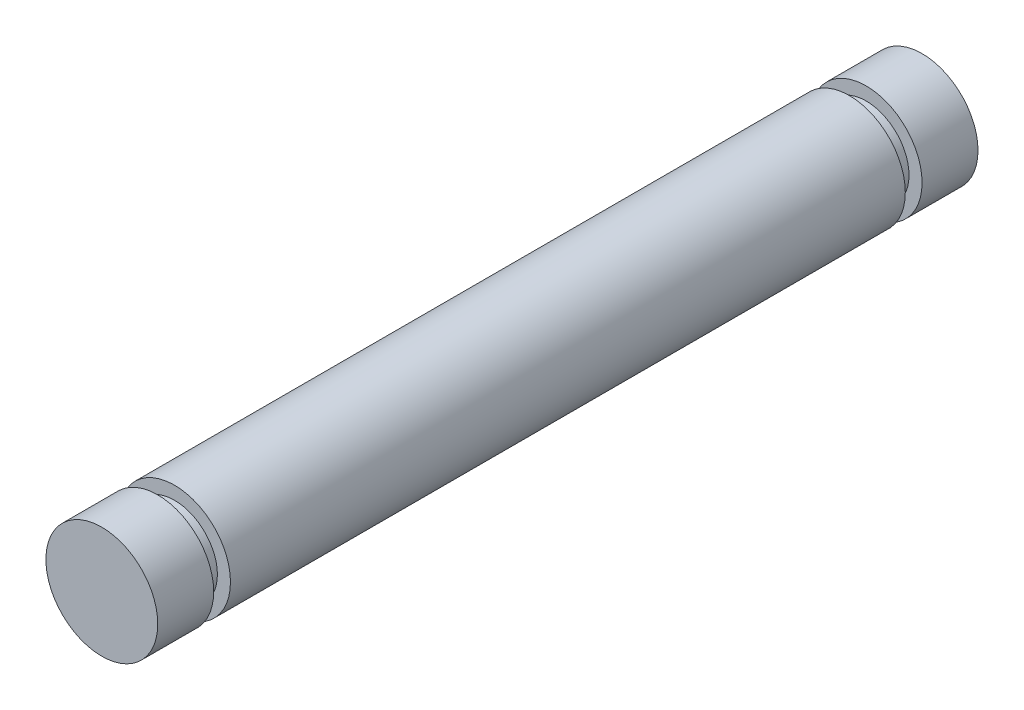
ISO-10303-21;
HEADER;
FILE_DESCRIPTION(('STEP AP214'),'2;1');
FILE_NAME('part.step','',(''),(''),'','','');
FILE_SCHEMA(('AUTOMOTIVE_DESIGN { 1 0 10303 214 1 1 1 1 }'));
ENDSEC;
DATA;
#1=APPLICATION_CONTEXT('core data for automotive mechanical design processes');
#2=APPLICATION_PROTOCOL_DEFINITION('international standard','automotive_design',2000,#1);
#3=PRODUCT_CONTEXT('',#1,'mechanical');
#4=PRODUCT('Part','Part','',(#3));
#5=PRODUCT_RELATED_PRODUCT_CATEGORY('part','',(#4));
#6=PRODUCT_DEFINITION_FORMATION('','',#4);
#7=PRODUCT_DEFINITION_CONTEXT('part definition',#1,'design');
#8=PRODUCT_DEFINITION('design','',#6,#7);
#9=PRODUCT_DEFINITION_SHAPE('','',#8);
#10=(LENGTH_UNIT() NAMED_UNIT(*) SI_UNIT(.MILLI.,.METRE.));
#11=(NAMED_UNIT(*) PLANE_ANGLE_UNIT() SI_UNIT($,.RADIAN.));
#12=(NAMED_UNIT(*) SI_UNIT($,.STERADIAN.) SOLID_ANGLE_UNIT());
#13=UNCERTAINTY_MEASURE_WITH_UNIT(LENGTH_MEASURE(1.E-05),#10,'distance_accuracy_value','');
#14=(GEOMETRIC_REPRESENTATION_CONTEXT(3) GLOBAL_UNCERTAINTY_ASSIGNED_CONTEXT((#13)) GLOBAL_UNIT_ASSIGNED_CONTEXT((#10,
#11,#12)) REPRESENTATION_CONTEXT('',''));
#15=CARTESIAN_POINT('',(0.,0.,0.));
#16=DIRECTION('',(0.,0.,1.));
#17=DIRECTION('',(1.,0.,0.));
#18=AXIS2_PLACEMENT_3D('',#15,#16,#17);
#19=CARTESIAN_POINT('',(-14.75,36.,11.));
#20=DIRECTION('',(0.,0.,-1.));
#21=DIRECTION('',(-1.,0.,0.));
#22=AXIS2_PLACEMENT_3D('',#19,#20,#21);
#23=CYLINDRICAL_SURFACE('',#22,1.5);
#24=CARTESIAN_POINT('',(-14.75,36.,9.05));
#25=DIRECTION('',(0.,0.,1.));
#26=DIRECTION('',(1.,0.,0.));
#27=AXIS2_PLACEMENT_3D('',#24,#25,#26);
#28=CIRCLE('',#27,1.5);
#29=CARTESIAN_POINT('',(-13.25,36.,9.05));
#30=VERTEX_POINT('',#29);
#31=EDGE_CURVE('E39',#30,#30,#28,.T.);
#32=ORIENTED_EDGE('',*,*,#31,.F.);
#33=EDGE_LOOP('',(#32));
#34=FACE_BOUND('',#33,.T.);
#35=CARTESIAN_POINT('',(-14.75,36.,-9.05));
#36=DIRECTION('',(0.,0.,1.));
#37=DIRECTION('',(1.,0.,0.));
#38=AXIS2_PLACEMENT_3D('',#35,#36,#37);
#39=CIRCLE('',#38,1.5);
#40=CARTESIAN_POINT('',(-13.25,36.,-9.05));
#41=VERTEX_POINT('',#40);
#42=EDGE_CURVE('E54',#41,#41,#39,.T.);
#43=ORIENTED_EDGE('',*,*,#42,.T.);
#44=EDGE_LOOP('',(#43));
#45=FACE_BOUND('',#44,.T.);
#46=ADVANCED_FACE('F28',(#34,#45),#23,.T.);
#47=CARTESIAN_POINT('',(-14.75,36.,9.05));
#48=DIRECTION('',(0.,0.,1.));
#49=DIRECTION('',(1.,0.,0.));
#50=AXIS2_PLACEMENT_3D('',#47,#48,#49);
#51=PLANE('',#50);
#52=CARTESIAN_POINT('',(-14.75,36.,9.05));
#53=DIRECTION('',(0.,0.,1.));
#54=DIRECTION('',(1.,0.,0.));
#55=AXIS2_PLACEMENT_3D('',#52,#53,#54);
#56=CIRCLE('',#55,1.15);
#57=CARTESIAN_POINT('',(-13.6,36.,9.05));
#58=VERTEX_POINT('',#57);
#59=EDGE_CURVE('E48',#58,#58,#56,.T.);
#60=ORIENTED_EDGE('',*,*,#59,.F.);
#61=EDGE_LOOP('',(#60));
#62=FACE_BOUND('',#61,.T.);
#63=ORIENTED_EDGE('',*,*,#31,.T.);
#64=EDGE_LOOP('',(#63));
#65=FACE_BOUND('',#64,.T.);
#66=ADVANCED_FACE('F84',(#62,#65),#51,.T.);
#67=CARTESIAN_POINT('',(-14.75,36.,9.5));
#68=DIRECTION('',(0.,0.,1.));
#69=DIRECTION('',(1.,0.,0.));
#70=AXIS2_PLACEMENT_3D('',#67,#68,#69);
#71=PLANE('',#70);
#72=CARTESIAN_POINT('',(-14.75,36.,9.5));
#73=DIRECTION('',(0.,0.,1.));
#74=DIRECTION('',(1.,0.,0.));
#75=AXIS2_PLACEMENT_3D('',#72,#73,#74);
#76=CIRCLE('',#75,1.15);
#77=CARTESIAN_POINT('',(-13.6,36.,9.5));
#78=VERTEX_POINT('',#77);
#79=EDGE_CURVE('E51',#78,#78,#76,.T.);
#80=ORIENTED_EDGE('',*,*,#79,.T.);
#81=EDGE_LOOP('',(#80));
#82=FACE_BOUND('',#81,.T.);
#83=CARTESIAN_POINT('',(-14.75,36.,9.5));
#84=DIRECTION('',(0.,0.,1.));
#85=DIRECTION('',(1.,0.,0.));
#86=AXIS2_PLACEMENT_3D('',#83,#84,#85);
#87=CIRCLE('',#86,1.5);
#88=CARTESIAN_POINT('',(-13.25,36.,9.5));
#89=VERTEX_POINT('',#88);
#90=EDGE_CURVE('E43',#89,#89,#87,.T.);
#91=ORIENTED_EDGE('',*,*,#90,.F.);
#92=EDGE_LOOP('',(#91));
#93=FACE_BOUND('',#92,.T.);
#94=ADVANCED_FACE('F90',(#82,#93),#71,.F.);
#95=CARTESIAN_POINT('',(-14.75,36.,9.05));
#96=DIRECTION('',(0.,0.,1.));
#97=DIRECTION('',(1.,0.,0.));
#98=AXIS2_PLACEMENT_3D('',#95,#96,#97);
#99=CYLINDRICAL_SURFACE('',#98,1.15);
#100=ORIENTED_EDGE('',*,*,#59,.T.);
#101=EDGE_LOOP('',(#100));
#102=FACE_BOUND('',#101,.T.);
#103=ORIENTED_EDGE('',*,*,#79,.F.);
#104=EDGE_LOOP('',(#103));
#105=FACE_BOUND('',#104,.T.);
#106=ADVANCED_FACE('F103',(#102,#105),#99,.T.);
#107=CARTESIAN_POINT('',(-14.75,36.,11.));
#108=DIRECTION('',(0.,0.,1.));
#109=DIRECTION('',(1.,0.,0.));
#110=AXIS2_PLACEMENT_3D('',#107,#108,#109);
#111=PLANE('',#110);
#112=CARTESIAN_POINT('',(-14.75,36.,11.));
#113=DIRECTION('',(0.,0.,1.));
#114=DIRECTION('',(1.,0.,0.));
#115=AXIS2_PLACEMENT_3D('',#112,#113,#114);
#116=CIRCLE('',#115,1.5);
#117=CARTESIAN_POINT('',(-13.25,36.,11.));
#118=VERTEX_POINT('',#117);
#119=EDGE_CURVE('E10',#118,#118,#116,.T.);
#120=ORIENTED_EDGE('',*,*,#119,.T.);
#121=EDGE_LOOP('',(#120));
#122=FACE_BOUND('',#121,.T.);
#123=ADVANCED_FACE('F98',(#122),#111,.T.);
#124=ORIENTED_EDGE('',*,*,#90,.T.);
#125=EDGE_LOOP('',(#124));
#126=FACE_BOUND('',#125,.T.);
#127=ORIENTED_EDGE('',*,*,#119,.F.);
#128=EDGE_LOOP('',(#127));
#129=FACE_BOUND('',#128,.T.);
#130=ADVANCED_FACE('F30',(#126,#129),#23,.T.);
#131=CARTESIAN_POINT('',(-14.75,36.,-9.05));
#132=DIRECTION('',(0.,0.,-1.));
#133=DIRECTION('',(1.,0.,0.));
#134=AXIS2_PLACEMENT_3D('',#131,#132,#133);
#135=PLANE('',#134);
#136=ORIENTED_EDGE('',*,*,#42,.F.);
#137=EDGE_LOOP('',(#136));
#138=FACE_BOUND('',#137,.T.);
#139=CARTESIAN_POINT('',(-14.75,36.,-9.05));
#140=DIRECTION('',(0.,0.,1.));
#141=DIRECTION('',(1.,0.,0.));
#142=AXIS2_PLACEMENT_3D('',#139,#140,#141);
#143=CIRCLE('',#142,1.15);
#144=CARTESIAN_POINT('',(-13.6,36.,-9.05));
#145=VERTEX_POINT('',#144);
#146=EDGE_CURVE('E60',#145,#145,#143,.T.);
#147=ORIENTED_EDGE('',*,*,#146,.T.);
#148=EDGE_LOOP('',(#147));
#149=FACE_BOUND('',#148,.T.);
#150=ADVANCED_FACE('F71',(#138,#149),#135,.T.);
#151=CARTESIAN_POINT('',(-14.75,36.,-9.5));
#152=DIRECTION('',(0.,0.,-1.));
#153=DIRECTION('',(1.,0.,0.));
#154=AXIS2_PLACEMENT_3D('',#151,#152,#153);
#155=PLANE('',#154);
#156=CARTESIAN_POINT('',(-14.75,36.,-9.5));
#157=DIRECTION('',(0.,0.,1.));
#158=DIRECTION('',(1.,0.,0.));
#159=AXIS2_PLACEMENT_3D('',#156,#157,#158);
#160=CIRCLE('',#159,1.5);
#161=CARTESIAN_POINT('',(-13.25,36.,-9.5));
#162=VERTEX_POINT('',#161);
#163=EDGE_CURVE('E57',#162,#162,#160,.T.);
#164=ORIENTED_EDGE('',*,*,#163,.T.);
#165=EDGE_LOOP('',(#164));
#166=FACE_BOUND('',#165,.T.);
#167=CARTESIAN_POINT('',(-14.75,36.,-9.5));
#168=DIRECTION('',(0.,0.,1.));
#169=DIRECTION('',(1.,0.,0.));
#170=AXIS2_PLACEMENT_3D('',#167,#168,#169);
#171=CIRCLE('',#170,1.15);
#172=CARTESIAN_POINT('',(-13.6,36.,-9.5));
#173=VERTEX_POINT('',#172);
#174=EDGE_CURVE('E63',#173,#173,#171,.T.);
#175=ORIENTED_EDGE('',*,*,#174,.F.);
#176=EDGE_LOOP('',(#175));
#177=FACE_BOUND('',#176,.T.);
#178=ADVANCED_FACE('F69',(#166,#177),#155,.F.);
#179=CARTESIAN_POINT('',(-14.75,36.,-9.05));
#180=DIRECTION('',(0.,0.,-1.));
#181=DIRECTION('',(-1.,0.,0.));
#182=AXIS2_PLACEMENT_3D('',#179,#180,#181);
#183=CYLINDRICAL_SURFACE('',#182,1.15);
#184=ORIENTED_EDGE('',*,*,#146,.F.);
#185=EDGE_LOOP('',(#184));
#186=FACE_BOUND('',#185,.T.);
#187=ORIENTED_EDGE('',*,*,#174,.T.);
#188=EDGE_LOOP('',(#187));
#189=FACE_BOUND('',#188,.T.);
#190=ADVANCED_FACE('F67',(#186,#189),#183,.T.);
#191=CARTESIAN_POINT('',(-14.75,36.,-11.));
#192=DIRECTION('',(0.,0.,1.));
#193=DIRECTION('',(1.,0.,0.));
#194=AXIS2_PLACEMENT_3D('',#191,#192,#193);
#195=PLANE('',#194);
#196=CARTESIAN_POINT('',(-14.75,36.,-11.));
#197=DIRECTION('',(0.,0.,1.));
#198=DIRECTION('',(1.,0.,0.));
#199=AXIS2_PLACEMENT_3D('',#196,#197,#198);
#200=CIRCLE('',#199,1.5);
#201=CARTESIAN_POINT('',(-13.25,36.,-11.));
#202=VERTEX_POINT('',#201);
#203=EDGE_CURVE('E35',#202,#202,#200,.T.);
#204=ORIENTED_EDGE('',*,*,#203,.F.);
#205=EDGE_LOOP('',(#204));
#206=FACE_BOUND('',#205,.T.);
#207=ADVANCED_FACE('F78',(#206),#195,.F.);
#208=ORIENTED_EDGE('',*,*,#163,.F.);
#209=EDGE_LOOP('',(#208));
#210=FACE_BOUND('',#209,.T.);
#211=ORIENTED_EDGE('',*,*,#203,.T.);
#212=EDGE_LOOP('',(#211));
#213=FACE_BOUND('',#212,.T.);
#214=ADVANCED_FACE('F86',(#210,#213),#23,.T.);
#215=CLOSED_SHELL('',(#46,#66,#94,#106,#123,#130,#150,#178,#190,#207,#214));
#216=MANIFOLD_SOLID_BREP('B2',#215);
#217=ADVANCED_BREP_SHAPE_REPRESENTATION('',(#18,#216),#14);
#218=SHAPE_DEFINITION_REPRESENTATION(#9,#217);
ENDSEC;
END-ISO-10303-21;
